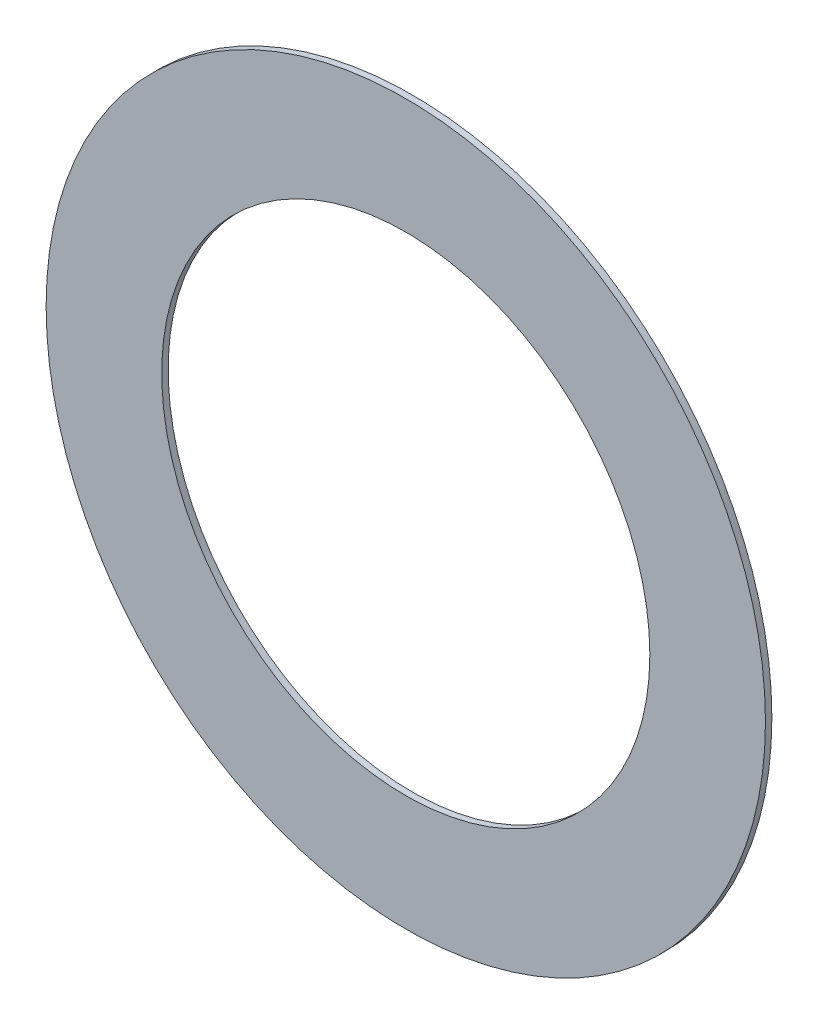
ISO-10303-21;
HEADER;
FILE_DESCRIPTION(('STEP AP214'),'2;1');
FILE_NAME('part.step','',(''),(''),'','','');
FILE_SCHEMA(('AUTOMOTIVE_DESIGN { 1 0 10303 214 1 1 1 1 }'));
ENDSEC;
DATA;
#1=APPLICATION_CONTEXT('core data for automotive mechanical design processes');
#2=APPLICATION_PROTOCOL_DEFINITION('international standard','automotive_design',2000,#1);
#3=PRODUCT_CONTEXT('',#1,'mechanical');
#4=PRODUCT('Part','Part','',(#3));
#5=PRODUCT_RELATED_PRODUCT_CATEGORY('part','',(#4));
#6=PRODUCT_DEFINITION_FORMATION('','',#4);
#7=PRODUCT_DEFINITION_CONTEXT('part definition',#1,'design');
#8=PRODUCT_DEFINITION('design','',#6,#7);
#9=PRODUCT_DEFINITION_SHAPE('','',#8);
#10=(LENGTH_UNIT() NAMED_UNIT(*) SI_UNIT(.MILLI.,.METRE.));
#11=(NAMED_UNIT(*) PLANE_ANGLE_UNIT() SI_UNIT($,.RADIAN.));
#12=(NAMED_UNIT(*) SI_UNIT($,.STERADIAN.) SOLID_ANGLE_UNIT());
#13=UNCERTAINTY_MEASURE_WITH_UNIT(LENGTH_MEASURE(1.E-05),#10,'distance_accuracy_value','');
#14=(GEOMETRIC_REPRESENTATION_CONTEXT(3) GLOBAL_UNCERTAINTY_ASSIGNED_CONTEXT((#13)) GLOBAL_UNIT_ASSIGNED_CONTEXT((#10,
#11,#12)) REPRESENTATION_CONTEXT('',''));
#15=CARTESIAN_POINT('',(0.,0.,0.));
#16=DIRECTION('',(0.,0.,1.));
#17=DIRECTION('',(1.,0.,0.));
#18=AXIS2_PLACEMENT_3D('',#15,#16,#17);
#19=CARTESIAN_POINT('',(0.,14.,0.125000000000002));
#20=DIRECTION('',(0.,0.,-1.));
#21=DIRECTION('',(-1.,0.,0.));
#22=AXIS2_PLACEMENT_3D('',#19,#20,#21);
#23=PLANE('',#22);
#24=CARTESIAN_POINT('',(0.,0.,0.125000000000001));
#25=DIRECTION('',(0.,0.,1.));
#26=DIRECTION('',(1.,0.,0.));
#27=AXIS2_PLACEMENT_3D('',#24,#25,#26);
#28=CIRCLE('',#27,9.5);
#29=CARTESIAN_POINT('',(9.5,0.,0.125000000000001));
#30=VERTEX_POINT('',#29);
#31=EDGE_CURVE('E44',#30,#30,#28,.T.);
#32=ORIENTED_EDGE('',*,*,#31,.F.);
#33=EDGE_LOOP('',(#32));
#34=FACE_BOUND('',#33,.T.);
#35=CARTESIAN_POINT('',(0.,0.,0.125000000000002));
#36=DIRECTION('',(0.,0.,1.));
#37=DIRECTION('',(1.,0.,0.));
#38=AXIS2_PLACEMENT_3D('',#35,#36,#37);
#39=CIRCLE('',#38,14.);
#40=CARTESIAN_POINT('',(14.,0.,0.125000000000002));
#41=VERTEX_POINT('',#40);
#42=EDGE_CURVE('E10',#41,#41,#39,.T.);
#43=ORIENTED_EDGE('',*,*,#42,.T.);
#44=EDGE_LOOP('',(#43));
#45=FACE_BOUND('',#44,.T.);
#46=ADVANCED_FACE('F30',(#34,#45),#23,.F.);
#47=CARTESIAN_POINT('',(0.,0.,0.));
#48=DIRECTION('',(0.,0.,1.));
#49=DIRECTION('',(1.,0.,0.));
#50=AXIS2_PLACEMENT_3D('',#47,#48,#49);
#51=CYLINDRICAL_SURFACE('',#50,14.);
#52=CARTESIAN_POINT('',(0.,0.,-0.124999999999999));
#53=DIRECTION('',(0.,0.,1.));
#54=DIRECTION('',(1.,0.,0.));
#55=AXIS2_PLACEMENT_3D('',#52,#53,#54);
#56=CIRCLE('',#55,14.);
#57=CARTESIAN_POINT('',(14.,0.,-0.124999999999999));
#58=VERTEX_POINT('',#57);
#59=EDGE_CURVE('E36',#58,#58,#56,.T.);
#60=ORIENTED_EDGE('',*,*,#59,.T.);
#61=EDGE_LOOP('',(#60));
#62=FACE_BOUND('',#61,.T.);
#63=ORIENTED_EDGE('',*,*,#42,.F.);
#64=EDGE_LOOP('',(#63));
#65=FACE_BOUND('',#64,.T.);
#66=ADVANCED_FACE('F54',(#62,#65),#51,.T.);
#67=CARTESIAN_POINT('',(0.,9.5,-0.124999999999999));
#68=DIRECTION('',(0.,0.,1.));
#69=DIRECTION('',(1.,0.,0.));
#70=AXIS2_PLACEMENT_3D('',#67,#68,#69);
#71=PLANE('',#70);
#72=ORIENTED_EDGE('',*,*,#59,.F.);
#73=EDGE_LOOP('',(#72));
#74=FACE_BOUND('',#73,.T.);
#75=CARTESIAN_POINT('',(0.,0.,-0.124999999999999));
#76=DIRECTION('',(0.,0.,1.));
#77=DIRECTION('',(1.,0.,0.));
#78=AXIS2_PLACEMENT_3D('',#75,#76,#77);
#79=CIRCLE('',#78,9.5);
#80=CARTESIAN_POINT('',(9.5,0.,-0.124999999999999));
#81=VERTEX_POINT('',#80);
#82=EDGE_CURVE('E40',#81,#81,#79,.T.);
#83=ORIENTED_EDGE('',*,*,#82,.T.);
#84=EDGE_LOOP('',(#83));
#85=FACE_BOUND('',#84,.T.);
#86=ADVANCED_FACE('F58',(#74,#85),#71,.F.);
#87=CARTESIAN_POINT('',(0.,0.,0.));
#88=DIRECTION('',(0.,0.,1.));
#89=DIRECTION('',(1.,0.,0.));
#90=AXIS2_PLACEMENT_3D('',#87,#88,#89);
#91=CYLINDRICAL_SURFACE('',#90,9.5);
#92=ORIENTED_EDGE('',*,*,#31,.T.);
#93=EDGE_LOOP('',(#92));
#94=FACE_BOUND('',#93,.T.);
#95=ORIENTED_EDGE('',*,*,#82,.F.);
#96=EDGE_LOOP('',(#95));
#97=FACE_BOUND('',#96,.T.);
#98=ADVANCED_FACE('F50',(#94,#97),#91,.F.);
#99=CLOSED_SHELL('',(#46,#66,#86,#98));
#100=MANIFOLD_SOLID_BREP('B2',#99);
#101=ADVANCED_BREP_SHAPE_REPRESENTATION('',(#18,#100),#14);
#102=SHAPE_DEFINITION_REPRESENTATION(#9,#101);
ENDSEC;
END-ISO-10303-21;
